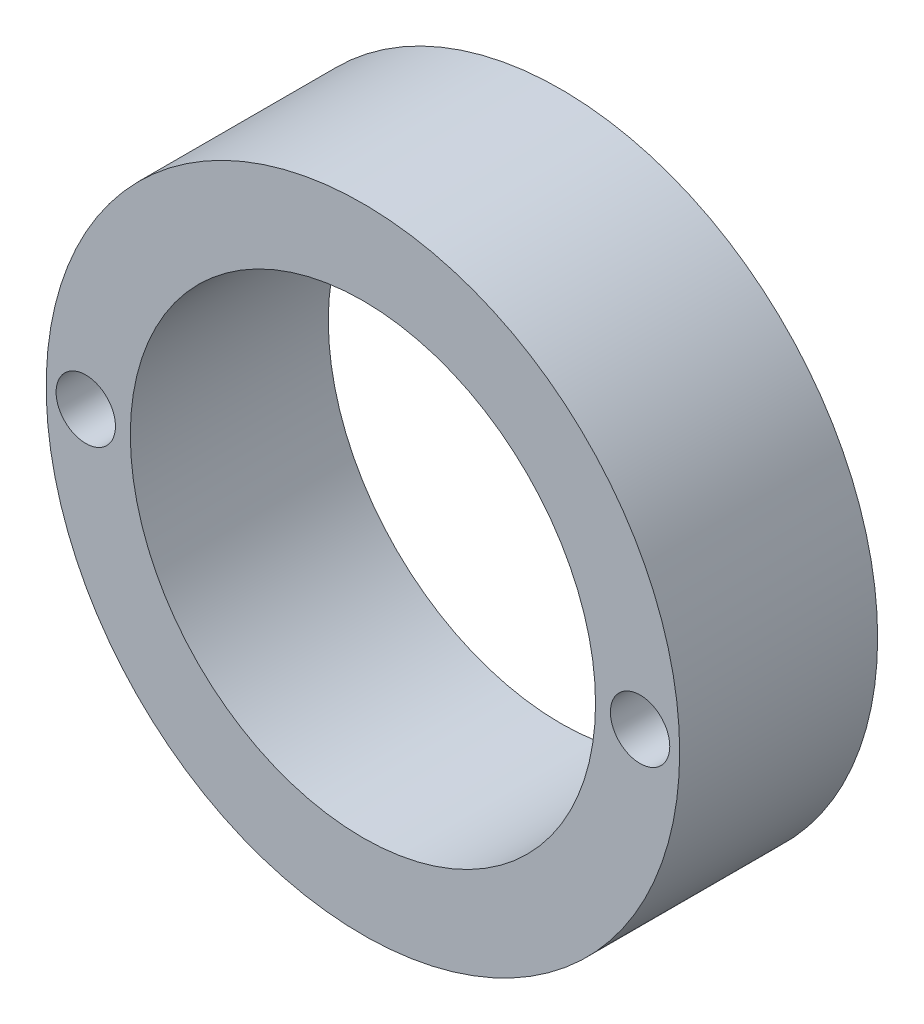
ISO-10303-21;
HEADER;
FILE_DESCRIPTION(('STEP AP214'),'2;1');
FILE_NAME('part.step','',(''),(''),'','','');
FILE_SCHEMA(('AUTOMOTIVE_DESIGN { 1 0 10303 214 1 1 1 1 }'));
ENDSEC;
DATA;
#1=APPLICATION_CONTEXT('core data for automotive mechanical design processes');
#2=APPLICATION_PROTOCOL_DEFINITION('international standard','automotive_design',2000,#1);
#3=PRODUCT_CONTEXT('',#1,'mechanical');
#4=PRODUCT('Part','Part','',(#3));
#5=PRODUCT_RELATED_PRODUCT_CATEGORY('part','',(#4));
#6=PRODUCT_DEFINITION_FORMATION('','',#4);
#7=PRODUCT_DEFINITION_CONTEXT('part definition',#1,'design');
#8=PRODUCT_DEFINITION('design','',#6,#7);
#9=PRODUCT_DEFINITION_SHAPE('','',#8);
#10=(LENGTH_UNIT() NAMED_UNIT(*) SI_UNIT(.MILLI.,.METRE.));
#11=(NAMED_UNIT(*) PLANE_ANGLE_UNIT() SI_UNIT($,.RADIAN.));
#12=(NAMED_UNIT(*) SI_UNIT($,.STERADIAN.) SOLID_ANGLE_UNIT());
#13=UNCERTAINTY_MEASURE_WITH_UNIT(LENGTH_MEASURE(1.E-05),#10,'distance_accuracy_value','');
#14=(GEOMETRIC_REPRESENTATION_CONTEXT(3) GLOBAL_UNCERTAINTY_ASSIGNED_CONTEXT((#13)) GLOBAL_UNIT_ASSIGNED_CONTEXT((#10,
#11,#12)) REPRESENTATION_CONTEXT('',''));
#15=CARTESIAN_POINT('',(0.,0.,0.));
#16=DIRECTION('',(0.,0.,1.));
#17=DIRECTION('',(1.,0.,0.));
#18=AXIS2_PLACEMENT_3D('',#15,#16,#17);
#19=CARTESIAN_POINT('',(0.,0.,20.));
#20=DIRECTION('',(0.,0.,1.));
#21=DIRECTION('',(1.,0.,0.));
#22=AXIS2_PLACEMENT_3D('',#19,#20,#21);
#23=PLANE('',#22);
#24=CARTESIAN_POINT('',(-28.,0.,20.));
#25=DIRECTION('',(0.,0.,1.));
#26=DIRECTION('',(1.,0.,0.));
#27=AXIS2_PLACEMENT_3D('',#24,#25,#26);
#28=CIRCLE('',#27,3.);
#29=CARTESIAN_POINT('',(-25.,0.,20.));
#30=VERTEX_POINT('',#29);
#31=EDGE_CURVE('E51',#30,#30,#28,.T.);
#32=ORIENTED_EDGE('',*,*,#31,.F.);
#33=EDGE_LOOP('',(#32));
#34=FACE_BOUND('',#33,.T.);
#35=CARTESIAN_POINT('',(0.,0.,20.));
#36=DIRECTION('',(0.,0.,1.));
#37=DIRECTION('',(1.,0.,0.));
#38=AXIS2_PLACEMENT_3D('',#35,#36,#37);
#39=CIRCLE('',#38,32.);
#40=CARTESIAN_POINT('',(32.,0.,20.));
#41=VERTEX_POINT('',#40);
#42=EDGE_CURVE('E10',#41,#41,#39,.T.);
#43=ORIENTED_EDGE('',*,*,#42,.T.);
#44=EDGE_LOOP('',(#43));
#45=FACE_BOUND('',#44,.T.);
#46=CARTESIAN_POINT('',(0.,0.,20.));
#47=DIRECTION('',(0.,0.,1.));
#48=DIRECTION('',(1.,0.,0.));
#49=AXIS2_PLACEMENT_3D('',#46,#47,#48);
#50=CIRCLE('',#49,23.5);
#51=CARTESIAN_POINT('',(23.5,0.,20.));
#52=VERTEX_POINT('',#51);
#53=EDGE_CURVE('E42',#52,#52,#50,.T.);
#54=ORIENTED_EDGE('',*,*,#53,.F.);
#55=EDGE_LOOP('',(#54));
#56=FACE_BOUND('',#55,.T.);
#57=CARTESIAN_POINT('',(28.,0.,20.));
#58=DIRECTION('',(0.,0.,1.));
#59=DIRECTION('',(1.,0.,0.));
#60=AXIS2_PLACEMENT_3D('',#57,#58,#59);
#61=CIRCLE('',#60,3.);
#62=CARTESIAN_POINT('',(31.,0.,20.));
#63=VERTEX_POINT('',#62);
#64=EDGE_CURVE('E57',#63,#63,#61,.T.);
#65=ORIENTED_EDGE('',*,*,#64,.F.);
#66=EDGE_LOOP('',(#65));
#67=FACE_BOUND('',#66,.T.);
#68=ADVANCED_FACE('F31',(#34,#45,#56,#67),#23,.T.);
#69=CARTESIAN_POINT('',(0.,0.,0.));
#70=DIRECTION('',(0.,0.,1.));
#71=DIRECTION('',(1.,0.,0.));
#72=AXIS2_PLACEMENT_3D('',#69,#70,#71);
#73=PLANE('',#72);
#74=CARTESIAN_POINT('',(-28.,0.,0.));
#75=DIRECTION('',(0.,0.,1.));
#76=DIRECTION('',(1.,0.,0.));
#77=AXIS2_PLACEMENT_3D('',#74,#75,#76);
#78=CIRCLE('',#77,3.);
#79=CARTESIAN_POINT('',(-25.,0.,0.));
#80=VERTEX_POINT('',#79);
#81=EDGE_CURVE('E54',#80,#80,#78,.T.);
#82=ORIENTED_EDGE('',*,*,#81,.T.);
#83=EDGE_LOOP('',(#82));
#84=FACE_BOUND('',#83,.T.);
#85=CARTESIAN_POINT('',(0.,0.,0.));
#86=DIRECTION('',(0.,0.,1.));
#87=DIRECTION('',(1.,0.,0.));
#88=AXIS2_PLACEMENT_3D('',#85,#86,#87);
#89=CIRCLE('',#88,32.);
#90=CARTESIAN_POINT('',(32.,0.,0.));
#91=VERTEX_POINT('',#90);
#92=EDGE_CURVE('E38',#91,#91,#89,.T.);
#93=ORIENTED_EDGE('',*,*,#92,.F.);
#94=EDGE_LOOP('',(#93));
#95=FACE_BOUND('',#94,.T.);
#96=CARTESIAN_POINT('',(0.,0.,0.));
#97=DIRECTION('',(0.,0.,1.));
#98=DIRECTION('',(1.,0.,0.));
#99=AXIS2_PLACEMENT_3D('',#96,#97,#98);
#100=CIRCLE('',#99,23.5);
#101=CARTESIAN_POINT('',(23.5,0.,0.));
#102=VERTEX_POINT('',#101);
#103=EDGE_CURVE('E46',#102,#102,#100,.T.);
#104=ORIENTED_EDGE('',*,*,#103,.T.);
#105=EDGE_LOOP('',(#104));
#106=FACE_BOUND('',#105,.T.);
#107=CARTESIAN_POINT('',(28.,0.,0.));
#108=DIRECTION('',(0.,0.,1.));
#109=DIRECTION('',(1.,0.,0.));
#110=AXIS2_PLACEMENT_3D('',#107,#108,#109);
#111=CIRCLE('',#110,3.);
#112=CARTESIAN_POINT('',(31.,0.,0.));
#113=VERTEX_POINT('',#112);
#114=EDGE_CURVE('E60',#113,#113,#111,.T.);
#115=ORIENTED_EDGE('',*,*,#114,.T.);
#116=EDGE_LOOP('',(#115));
#117=FACE_BOUND('',#116,.T.);
#118=ADVANCED_FACE('F64',(#84,#95,#106,#117),#73,.F.);
#119=CARTESIAN_POINT('',(0.,0.,20.));
#120=DIRECTION('',(0.,0.,-1.));
#121=DIRECTION('',(-1.,0.,0.));
#122=AXIS2_PLACEMENT_3D('',#119,#120,#121);
#123=CYLINDRICAL_SURFACE('',#122,32.);
#124=ORIENTED_EDGE('',*,*,#42,.F.);
#125=EDGE_LOOP('',(#124));
#126=FACE_BOUND('',#125,.T.);
#127=ORIENTED_EDGE('',*,*,#92,.T.);
#128=EDGE_LOOP('',(#127));
#129=FACE_BOUND('',#128,.T.);
#130=ADVANCED_FACE('F33',(#126,#129),#123,.T.);
#131=CARTESIAN_POINT('',(0.,0.,20.));
#132=DIRECTION('',(0.,0.,-1.));
#133=DIRECTION('',(-1.,0.,0.));
#134=AXIS2_PLACEMENT_3D('',#131,#132,#133);
#135=CYLINDRICAL_SURFACE('',#134,23.5);
#136=ORIENTED_EDGE('',*,*,#53,.T.);
#137=EDGE_LOOP('',(#136));
#138=FACE_BOUND('',#137,.T.);
#139=ORIENTED_EDGE('',*,*,#103,.F.);
#140=EDGE_LOOP('',(#139));
#141=FACE_BOUND('',#140,.T.);
#142=ADVANCED_FACE('F74',(#138,#141),#135,.F.);
#143=CARTESIAN_POINT('',(-28.,0.,20.));
#144=DIRECTION('',(0.,0.,-1.));
#145=DIRECTION('',(-1.,0.,0.));
#146=AXIS2_PLACEMENT_3D('',#143,#144,#145);
#147=CYLINDRICAL_SURFACE('',#146,3.);
#148=ORIENTED_EDGE('',*,*,#31,.T.);
#149=EDGE_LOOP('',(#148));
#150=FACE_BOUND('',#149,.T.);
#151=ORIENTED_EDGE('',*,*,#81,.F.);
#152=EDGE_LOOP('',(#151));
#153=FACE_BOUND('',#152,.T.);
#154=ADVANCED_FACE('F68',(#150,#153),#147,.F.);
#155=CARTESIAN_POINT('',(28.,0.,20.));
#156=DIRECTION('',(0.,0.,-1.));
#157=DIRECTION('',(-1.,0.,0.));
#158=AXIS2_PLACEMENT_3D('',#155,#156,#157);
#159=CYLINDRICAL_SURFACE('',#158,3.);
#160=ORIENTED_EDGE('',*,*,#64,.T.);
#161=EDGE_LOOP('',(#160));
#162=FACE_BOUND('',#161,.T.);
#163=ORIENTED_EDGE('',*,*,#114,.F.);
#164=EDGE_LOOP('',(#163));
#165=FACE_BOUND('',#164,.T.);
#166=ADVANCED_FACE('F66',(#162,#165),#159,.F.);
#167=CLOSED_SHELL('',(#68,#118,#130,#142,#154,#166));
#168=MANIFOLD_SOLID_BREP('B2',#167);
#169=ADVANCED_BREP_SHAPE_REPRESENTATION('',(#18,#168),#14);
#170=SHAPE_DEFINITION_REPRESENTATION(#9,#169);
ENDSEC;
END-ISO-10303-21;
